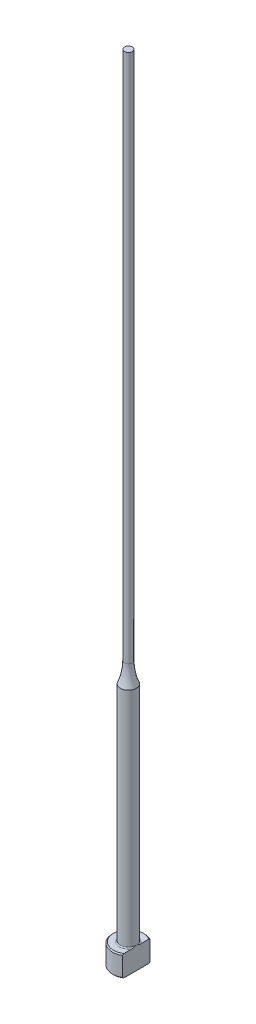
ISO-10303-21;
HEADER;
FILE_DESCRIPTION(('STEP AP214'),'2;1');
FILE_NAME('part.step','',(''),(''),'','','');
FILE_SCHEMA(('AUTOMOTIVE_DESIGN { 1 0 10303 214 1 1 1 1 }'));
ENDSEC;
DATA;
#1=APPLICATION_CONTEXT('core data for automotive mechanical design processes');
#2=APPLICATION_PROTOCOL_DEFINITION('international standard','automotive_design',2000,#1);
#3=PRODUCT_CONTEXT('',#1,'mechanical');
#4=PRODUCT('Part','Part','',(#3));
#5=PRODUCT_RELATED_PRODUCT_CATEGORY('part','',(#4));
#6=PRODUCT_DEFINITION_FORMATION('','',#4);
#7=PRODUCT_DEFINITION_CONTEXT('part definition',#1,'design');
#8=PRODUCT_DEFINITION('design','',#6,#7);
#9=PRODUCT_DEFINITION_SHAPE('','',#8);
#10=(LENGTH_UNIT() NAMED_UNIT(*) SI_UNIT(.MILLI.,.METRE.));
#11=(NAMED_UNIT(*) PLANE_ANGLE_UNIT() SI_UNIT($,.RADIAN.));
#12=(NAMED_UNIT(*) SI_UNIT($,.STERADIAN.) SOLID_ANGLE_UNIT());
#13=UNCERTAINTY_MEASURE_WITH_UNIT(LENGTH_MEASURE(1.E-05),#10,'distance_accuracy_value','');
#14=(GEOMETRIC_REPRESENTATION_CONTEXT(3) GLOBAL_UNCERTAINTY_ASSIGNED_CONTEXT((#13)) GLOBAL_UNIT_ASSIGNED_CONTEXT((#10,
#11,#12)) REPRESENTATION_CONTEXT('',''));
#15=CARTESIAN_POINT('',(0.,0.,0.));
#16=DIRECTION('',(0.,0.,1.));
#17=DIRECTION('',(1.,0.,0.));
#18=AXIS2_PLACEMENT_3D('',#15,#16,#17);
#19=CARTESIAN_POINT('',(-2.99999999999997,4.,0.));
#20=DIRECTION('',(0.,1.,0.));
#21=DIRECTION('',(0.,0.,1.));
#22=AXIS2_PLACEMENT_3D('',#19,#20,#21);
#23=PLANE('',#22);
#24=CARTESIAN_POINT('',(0.,4.,0.));
#25=DIRECTION('',(0.,1.,0.));
#26=DIRECTION('',(0.,0.,1.));
#27=AXIS2_PLACEMENT_3D('',#24,#25,#26);
#28=CIRCLE('',#27,2.79999999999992);
#29=CARTESIAN_POINT('',(1.49999999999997,4.,-2.3643180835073));
#30=VERTEX_POINT('',#29);
#31=CARTESIAN_POINT('',(1.49999999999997,4.,2.3643180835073));
#32=VERTEX_POINT('',#31);
#33=EDGE_CURVE('E187',#30,#32,#28,.T.);
#34=ORIENTED_EDGE('',*,*,#33,.T.);
#35=DIRECTION('',(0.,0.,-1.));
#36=VECTOR('',#35,1.);
#37=CARTESIAN_POINT('',(1.49999999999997,4.,0.));
#38=LINE('',#37,#36);
#39=CARTESIAN_POINT('',(1.49999999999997,3.99999999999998,0.799999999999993));
#40=VERTEX_POINT('',#39);
#41=EDGE_CURVE('E57',#32,#40,#38,.T.);
#42=ORIENTED_EDGE('',*,*,#41,.T.);
#43=CARTESIAN_POINT('',(0.,4.,0.));
#44=DIRECTION('',(0.,1.,0.));
#45=DIRECTION('',(0.,0.,1.));
#46=AXIS2_PLACEMENT_3D('',#43,#44,#45);
#47=CIRCLE('',#46,1.69999999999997);
#48=CARTESIAN_POINT('',(1.49999999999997,3.99999999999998,-0.799999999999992));
#49=VERTEX_POINT('',#48);
#50=EDGE_CURVE('E108',#40,#49,#47,.F.);
#51=ORIENTED_EDGE('',*,*,#50,.T.);
#52=EDGE_CURVE('E137',#49,#30,#38,.T.);
#53=ORIENTED_EDGE('',*,*,#52,.T.);
#54=EDGE_LOOP('',(#34,#42,#51,#53));
#55=FACE_BOUND('',#54,.T.);
#56=ADVANCED_FACE('F32',(#55),#23,.T.);
#57=CARTESIAN_POINT('',(0.,259.958771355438,0.));
#58=DIRECTION('',(0.,1.,0.));
#59=DIRECTION('',(0.,0.,1.));
#60=AXIS2_PLACEMENT_3D('',#57,#58,#59);
#61=CYLINDRICAL_SURFACE('',#60,2.99999999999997);
#62=CARTESIAN_POINT('',(0.,3.79999999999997,0.));
#63=DIRECTION('',(0.,1.,0.));
#64=DIRECTION('',(0.,0.,1.));
#65=AXIS2_PLACEMENT_3D('',#62,#63,#64);
#66=CIRCLE('',#65,2.99999999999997);
#67=CARTESIAN_POINT('',(1.49999999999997,3.79999999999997,2.5980762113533));
#68=VERTEX_POINT('',#67);
#69=CARTESIAN_POINT('',(1.49999999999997,3.79999999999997,-2.5980762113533));
#70=VERTEX_POINT('',#69);
#71=EDGE_CURVE('E105',#68,#70,#66,.F.);
#72=ORIENTED_EDGE('',*,*,#71,.T.);
#73=DIRECTION('',(0.,-1.,0.));
#74=VECTOR('',#73,1.);
#75=CARTESIAN_POINT('',(1.49999999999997,150.,-2.5980762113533));
#76=LINE('',#75,#74);
#77=CARTESIAN_POINT('',(1.49999999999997,0.199999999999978,-2.5980762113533));
#78=VERTEX_POINT('',#77);
#79=EDGE_CURVE('E193',#70,#78,#76,.T.);
#80=ORIENTED_EDGE('',*,*,#79,.T.);
#81=CARTESIAN_POINT('',(0.,0.199999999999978,0.));
#82=DIRECTION('',(0.,-1.,0.));
#83=DIRECTION('',(0.,0.,-1.));
#84=AXIS2_PLACEMENT_3D('',#81,#82,#83);
#85=CIRCLE('',#84,2.99999999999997);
#86=CARTESIAN_POINT('',(1.49999999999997,0.199999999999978,2.5980762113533));
#87=VERTEX_POINT('',#86);
#88=EDGE_CURVE('E100',#78,#87,#85,.F.);
#89=ORIENTED_EDGE('',*,*,#88,.T.);
#90=DIRECTION('',(0.,-1.,0.));
#91=VECTOR('',#90,1.);
#92=CARTESIAN_POINT('',(1.49999999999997,150.,2.5980762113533));
#93=LINE('',#92,#91);
#94=EDGE_CURVE('E93',#68,#87,#93,.T.);
#95=ORIENTED_EDGE('',*,*,#94,.F.);
#96=EDGE_LOOP('',(#72,#80,#89,#95));
#97=FACE_BOUND('',#96,.T.);
#98=ADVANCED_FACE('F158',(#97),#61,.T.);
#99=CARTESIAN_POINT('',(0.,0.,0.));
#100=DIRECTION('',(0.,-1.,0.));
#101=DIRECTION('',(0.,0.,-1.));
#102=AXIS2_PLACEMENT_3D('',#99,#100,#101);
#103=PLANE('',#102);
#104=CARTESIAN_POINT('',(0.,0.,0.));
#105=DIRECTION('',(0.,-1.,0.));
#106=DIRECTION('',(0.,0.,-1.));
#107=AXIS2_PLACEMENT_3D('',#104,#105,#106);
#108=CIRCLE('',#107,2.8);
#109=CARTESIAN_POINT('',(1.49999999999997,0.,2.36431808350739));
#110=VERTEX_POINT('',#109);
#111=CARTESIAN_POINT('',(1.49999999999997,0.,-2.36431808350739));
#112=VERTEX_POINT('',#111);
#113=EDGE_CURVE('E98',#110,#112,#108,.T.);
#114=ORIENTED_EDGE('',*,*,#113,.T.);
#115=DIRECTION('',(0.,0.,1.));
#116=VECTOR('',#115,1.);
#117=CARTESIAN_POINT('',(1.49999999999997,0.,2.5980762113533));
#118=LINE('',#117,#116);
#119=EDGE_CURVE('E83',#112,#110,#118,.T.);
#120=ORIENTED_EDGE('',*,*,#119,.T.);
#121=EDGE_LOOP('',(#114,#120));
#122=FACE_BOUND('',#121,.T.);
#123=ADVANCED_FACE('F103',(#122),#103,.T.);
#124=CARTESIAN_POINT('',(0.,4.,0.));
#125=DIRECTION('',(0.,-1.,0.));
#126=DIRECTION('',(0.,0.,-1.));
#127=AXIS2_PLACEMENT_3D('',#124,#125,#126);
#128=CONICAL_SURFACE('',#127,2.79999999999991,0.7853981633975);
#129=ORIENTED_EDGE('',*,*,#71,.F.);
#130=CARTESIAN_POINT('',(1.49999999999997,0.888258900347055,5.71827621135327));
#131=CARTESIAN_POINT('',(1.49999999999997,1.01361833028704,5.58866816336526));
#132=CARTESIAN_POINT('',(1.49999999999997,1.13884324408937,5.45892957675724));
#133=CARTESIAN_POINT('',(1.49999999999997,1.38894444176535,5.19911365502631));
#134=CARTESIAN_POINT('',(1.49999999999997,1.51382072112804,5.06903631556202));
#135=CARTESIAN_POINT('',(1.49999999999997,1.76320568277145,4.8084018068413));
#136=CARTESIAN_POINT('',(1.49999999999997,1.88771414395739,4.67784442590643));
#137=CARTESIAN_POINT('',(1.49999999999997,2.13618059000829,4.41620813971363));
#138=CARTESIAN_POINT('',(1.49999999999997,2.26013857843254,4.28512923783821));
#139=CARTESIAN_POINT('',(1.49999999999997,2.50488975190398,4.02490837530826));
#140=CARTESIAN_POINT('',(1.49999999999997,2.62569693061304,3.89577958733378));
#141=CARTESIAN_POINT('',(1.49999999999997,2.86640694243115,3.63668213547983));
#142=CARTESIAN_POINT('',(1.49999999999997,2.98630978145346,3.5067134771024));
#143=CARTESIAN_POINT('',(1.49999999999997,3.22486033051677,3.24567921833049));
#144=CARTESIAN_POINT('',(1.49999999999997,3.34350830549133,3.11461386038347));
#145=CARTESIAN_POINT('',(1.49999999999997,3.57907716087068,2.85094268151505));
#146=CARTESIAN_POINT('',(1.49999999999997,3.69599811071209,2.71833692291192));
#147=CARTESIAN_POINT('',(1.49999999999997,3.88262371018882,2.50255231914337));
#148=CARTESIAN_POINT('',(1.49999999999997,3.95312454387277,2.42006293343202));
#149=CARTESIAN_POINT('',(1.49999999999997,4.09287098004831,2.25401084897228));
#150=CARTESIAN_POINT('',(1.49999999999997,4.16211645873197,2.17044804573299));
#151=CARTESIAN_POINT('',(1.49999999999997,4.29964684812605,2.00105967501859));
#152=CARTESIAN_POINT('',(1.49999999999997,4.36791386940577,1.91521952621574));
#153=CARTESIAN_POINT('',(1.49999999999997,4.50205840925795,1.74171392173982));
#154=CARTESIAN_POINT('',(1.49999999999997,4.56793649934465,1.65404891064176));
#155=CARTESIAN_POINT('',(1.49999999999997,4.69728151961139,1.47490236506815));
#156=CARTESIAN_POINT('',(1.49999999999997,4.76069661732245,1.38338308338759));
#157=CARTESIAN_POINT('',(1.49999999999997,4.88239539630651,1.1967566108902));
#158=CARTESIAN_POINT('',(1.49999999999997,4.9406720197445,1.10164473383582));
#159=CARTESIAN_POINT('',(1.49999999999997,5.04841325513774,0.908008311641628));
#160=CARTESIAN_POINT('',(1.49999999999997,5.09797809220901,0.809540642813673));
#161=CARTESIAN_POINT('',(1.49999999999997,5.18432188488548,0.607192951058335));
#162=CARTESIAN_POINT('',(1.49999999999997,5.22114374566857,0.503332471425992));
#163=CARTESIAN_POINT('',(1.49999999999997,5.26099935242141,0.347577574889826));
#164=CARTESIAN_POINT('',(1.49999999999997,5.27157029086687,0.297609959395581));
#165=CARTESIAN_POINT('',(1.49999999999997,5.28794860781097,0.196885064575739));
#166=CARTESIAN_POINT('',(1.49999999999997,5.29375640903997,0.146127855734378));
#167=CARTESIAN_POINT('',(1.49999999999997,5.3001970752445,0.0444388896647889));
#168=CARTESIAN_POINT('',(1.49999999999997,5.3008459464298,-0.00649183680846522));
#169=CARTESIAN_POINT('',(1.49999999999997,5.29696416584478,-0.108155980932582));
#170=CARTESIAN_POINT('',(1.49999999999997,5.29243308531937,-0.158889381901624));
#171=CARTESIAN_POINT('',(1.49999999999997,5.2785691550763,-0.259234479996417));
#172=CARTESIAN_POINT('',(1.49999999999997,5.2692782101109,-0.308852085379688));
#173=CARTESIAN_POINT('',(1.49999999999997,5.24647108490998,-0.40711049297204));
#174=CARTESIAN_POINT('',(1.49999999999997,5.23295324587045,-0.455750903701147));
#175=CARTESIAN_POINT('',(1.49999999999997,5.20226175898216,-0.552149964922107));
#176=CARTESIAN_POINT('',(1.49999999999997,5.18506801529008,-0.5999021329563));
#177=CARTESIAN_POINT('',(1.49999999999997,5.14771387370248,-0.694205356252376));
#178=CARTESIAN_POINT('',(1.49999999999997,5.12755408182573,-0.740756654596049));
#179=CARTESIAN_POINT('',(1.49999999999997,5.06327696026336,-0.879166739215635));
#180=CARTESIAN_POINT('',(1.49999999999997,5.01551721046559,-0.969329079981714));
#181=CARTESIAN_POINT('',(1.49999999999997,4.91367909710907,-1.1460431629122));
#182=CARTESIAN_POINT('',(1.49999999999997,4.85959300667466,-1.23259031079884));
#183=CARTESIAN_POINT('',(1.49999999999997,4.74697968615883,-1.40321348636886));
#184=CARTESIAN_POINT('',(1.49999999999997,4.68843573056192,-1.48727838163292));
#185=CARTESIAN_POINT('',(1.49999999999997,4.56843845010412,-1.6532218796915));
#186=CARTESIAN_POINT('',(1.49999999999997,4.50698656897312,-1.73510153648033));
#187=CARTESIAN_POINT('',(1.49999999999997,4.38115673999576,-1.89829823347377));
#188=CARTESIAN_POINT('',(1.49999999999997,4.31675092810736,-1.9795936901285));
#189=CARTESIAN_POINT('',(1.49999999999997,4.18634068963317,-2.14090082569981));
#190=CARTESIAN_POINT('',(1.49999999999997,4.12033609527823,-2.22091236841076));
#191=CARTESIAN_POINT('',(1.49999999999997,3.92086431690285,-2.45906508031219));
#192=CARTESIAN_POINT('',(1.49999999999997,3.78562663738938,-2.61572090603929));
#193=CARTESIAN_POINT('',(1.49999999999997,3.53554498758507,-2.90006295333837));
#194=CARTESIAN_POINT('',(1.49999999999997,3.42114543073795,-3.02814382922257));
#195=CARTESIAN_POINT('',(1.49999999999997,3.19093557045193,-3.28303767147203));
#196=CARTESIAN_POINT('',(1.49999999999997,3.07512522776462,-3.40985060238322));
#197=CARTESIAN_POINT('',(1.49999999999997,2.72597067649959,-3.78913849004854));
#198=CARTESIAN_POINT('',(1.49999999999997,2.49111760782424,-4.04022177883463));
#199=CARTESIAN_POINT('',(1.49999999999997,2.02882478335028,-4.52992803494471));
#200=CARTESIAN_POINT('',(1.49999999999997,1.80147747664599,-4.76863870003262));
#201=CARTESIAN_POINT('',(1.49999999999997,1.45954865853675,-5.12558036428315));
#202=CARTESIAN_POINT('',(1.49999999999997,1.34548484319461,-5.24430773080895));
#203=CARTESIAN_POINT('',(1.49999999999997,1.11707176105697,-5.48148573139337));
#204=CARTESIAN_POINT('',(1.49999999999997,1.00272249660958,-5.59993636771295));
#205=CARTESIAN_POINT('',(1.49999999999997,0.888258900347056,-5.71827621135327));
#206=B_SPLINE_CURVE_WITH_KNOTS('',3,(#130,#131,#132,#133,#134,#135,#136,#137,#138,#139,#140,
#141,#142,#143,#144,#145,#146,#147,#148,#149,#150,#151,#152,#153,#154,#155,#156,#157,#158,#159,
#160,#161,#162,#163,#164,#165,#166,#167,#168,#169,#170,#171,#172,#173,#174,#175,#176,#177,#178,
#179,#180,#181,#182,#183,#184,#185,#186,#187,#188,#189,#190,#191,#192,#193,#194,#195,#196,#197,
#198,#199,#200,#201,#202,#203,#204,#205),.UNSPECIFIED.,.F.,.F.,(4,2,2,2,2,2,2,2,2,2,2,2,2,2,2,2,
2,2,2,2,2,2,2,2,2,2,2,2,2,2,2,2,2,2,2,2,2,4),(0.,0.540943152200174,1.08189327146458,
1.62312052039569,2.16434426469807,2.69482920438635,3.22531067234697,3.75567781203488,
4.28602356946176,4.61155053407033,4.93710943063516,5.26610945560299,5.59503024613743,
5.92894782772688,6.26331713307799,6.59354403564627,6.92264800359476,7.07567478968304,
7.22868799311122,7.38122626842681,7.53377717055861,7.68500755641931,7.83629736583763,
7.98843643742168,8.14054446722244,8.4461879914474,8.75220879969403,9.05944044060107,
9.366521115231,9.677642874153,9.98879742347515,10.6095925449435,11.1247803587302,
11.6399825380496,12.6713544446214,13.6603005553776,14.1542238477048,14.648143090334),.UNSPECIFIED.);
#207=EDGE_CURVE('E136',#68,#32,#206,.T.);
#208=ORIENTED_EDGE('',*,*,#207,.T.);
#209=ORIENTED_EDGE('',*,*,#33,.F.);
#210=EDGE_CURVE('E128',#30,#70,#206,.T.);
#211=ORIENTED_EDGE('',*,*,#210,.T.);
#212=EDGE_LOOP('',(#129,#208,#209,#211));
#213=FACE_BOUND('',#212,.T.);
#214=ADVANCED_FACE('F144',(#213),#128,.T.);
#215=CARTESIAN_POINT('',(0.,0.199999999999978,0.));
#216=DIRECTION('',(0.,1.,0.));
#217=DIRECTION('',(0.,0.,1.));
#218=AXIS2_PLACEMENT_3D('',#215,#216,#217);
#219=CONICAL_SURFACE('',#218,2.99999999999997,0.785398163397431);
#220=ORIENTED_EDGE('',*,*,#88,.F.);
#221=CARTESIAN_POINT('',(1.49999999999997,3.1117410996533,-5.71827621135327));
#222=CARTESIAN_POINT('',(1.49999999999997,2.98638166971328,-5.58866816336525));
#223=CARTESIAN_POINT('',(1.49999999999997,2.86115675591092,-5.45892957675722));
#224=CARTESIAN_POINT('',(1.49999999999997,2.61105555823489,-5.19911365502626));
#225=CARTESIAN_POINT('',(1.49999999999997,2.48617927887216,-5.06903631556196));
#226=CARTESIAN_POINT('',(1.49999999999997,2.23679431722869,-4.80840180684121));
#227=CARTESIAN_POINT('',(1.49999999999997,2.11228585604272,-4.67784442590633));
#228=CARTESIAN_POINT('',(1.49999999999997,1.86381940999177,-4.4162081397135));
#229=CARTESIAN_POINT('',(1.49999999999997,1.73986142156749,-4.28512923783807));
#230=CARTESIAN_POINT('',(1.49999999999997,1.49511024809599,-4.02490837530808));
#231=CARTESIAN_POINT('',(1.49999999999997,1.3743030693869,-3.8957795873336));
#232=CARTESIAN_POINT('',(1.49999999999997,1.13359305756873,-3.63668213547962));
#233=CARTESIAN_POINT('',(1.49999999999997,1.0136902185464,-3.50671347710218));
#234=CARTESIAN_POINT('',(1.49999999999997,0.77513966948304,-3.24567921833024));
#235=CARTESIAN_POINT('',(1.49999999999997,0.656491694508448,-3.11461386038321));
#236=CARTESIAN_POINT('',(1.49999999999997,0.420922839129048,-2.85094268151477));
#237=CARTESIAN_POINT('',(1.49999999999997,0.30400188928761,-2.71833692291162));
#238=CARTESIAN_POINT('',(1.49999999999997,0.11737628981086,-2.50255231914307));
#239=CARTESIAN_POINT('',(1.49999999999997,0.046875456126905,-2.42006293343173));
#240=CARTESIAN_POINT('',(1.49999999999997,-0.0928709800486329,-2.254010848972));
#241=CARTESIAN_POINT('',(1.49999999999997,-0.162116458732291,-2.17044804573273));
#242=CARTESIAN_POINT('',(1.49999999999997,-0.299646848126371,-2.00105967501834));
#243=CARTESIAN_POINT('',(1.49999999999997,-0.367913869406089,-1.9152195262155));
#244=CARTESIAN_POINT('',(1.49999999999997,-0.502058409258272,-1.7417139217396));
#245=CARTESIAN_POINT('',(1.49999999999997,-0.567936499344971,-1.65404891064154));
#246=CARTESIAN_POINT('',(1.49999999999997,-0.697281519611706,-1.47490236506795));
#247=CARTESIAN_POINT('',(1.49999999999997,-0.76069661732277,-1.38338308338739));
#248=CARTESIAN_POINT('',(1.49999999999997,-0.882395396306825,-1.19675661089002));
#249=CARTESIAN_POINT('',(1.49999999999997,-0.940672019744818,-1.10164473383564));
#250=CARTESIAN_POINT('',(1.49999999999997,-1.04841325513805,-0.908008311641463));
#251=CARTESIAN_POINT('',(1.49999999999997,-1.09797809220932,-0.809540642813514));
#252=CARTESIAN_POINT('',(1.49999999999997,-1.18432188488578,-0.607192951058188));
#253=CARTESIAN_POINT('',(1.49999999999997,-1.22114374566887,-0.50333247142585));
#254=CARTESIAN_POINT('',(1.49999999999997,-1.26099935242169,-0.347577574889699));
#255=CARTESIAN_POINT('',(1.49999999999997,-1.27157029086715,-0.297609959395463));
#256=CARTESIAN_POINT('',(1.49999999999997,-1.28794860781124,-0.196885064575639));
#257=CARTESIAN_POINT('',(1.49999999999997,-1.29375640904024,-0.146127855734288));
#258=CARTESIAN_POINT('',(1.49999999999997,-1.30019707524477,-0.0444388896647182));
#259=CARTESIAN_POINT('',(1.49999999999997,-1.30084594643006,0.00649183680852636));
#260=CARTESIAN_POINT('',(1.49999999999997,-1.29696416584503,0.108155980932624));
#261=CARTESIAN_POINT('',(1.49999999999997,-1.29243308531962,0.158889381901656));
#262=CARTESIAN_POINT('',(1.49999999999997,-1.27856915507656,0.25923447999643));
#263=CARTESIAN_POINT('',(1.49999999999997,-1.26927821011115,0.308852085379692));
#264=CARTESIAN_POINT('',(1.49999999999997,-1.24647108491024,0.407110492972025));
#265=CARTESIAN_POINT('',(1.49999999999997,-1.2329532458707,0.455750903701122));
#266=CARTESIAN_POINT('',(1.49999999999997,-1.20226175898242,0.552149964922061));
#267=CARTESIAN_POINT('',(1.49999999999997,-1.18506801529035,0.599902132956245));
#268=CARTESIAN_POINT('',(1.49999999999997,-1.14771387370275,0.694205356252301));
#269=CARTESIAN_POINT('',(1.49999999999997,-1.12755408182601,0.740756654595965));
#270=CARTESIAN_POINT('',(1.49999999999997,-1.06327696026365,0.879166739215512));
#271=CARTESIAN_POINT('',(1.49999999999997,-1.0155172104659,0.969329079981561));
#272=CARTESIAN_POINT('',(1.49999999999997,-0.913679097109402,1.14604316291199));
#273=CARTESIAN_POINT('',(1.49999999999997,-0.859593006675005,1.2325903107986));
#274=CARTESIAN_POINT('',(1.49999999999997,-0.746979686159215,1.40321348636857));
#275=CARTESIAN_POINT('',(1.49999999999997,-0.688435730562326,1.4872783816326));
#276=CARTESIAN_POINT('',(1.49999999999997,-0.568438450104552,1.65322187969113));
#277=CARTESIAN_POINT('',(1.49999999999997,-0.506986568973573,1.73510153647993));
#278=CARTESIAN_POINT('',(1.49999999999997,-0.381156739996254,1.89829823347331));
#279=CARTESIAN_POINT('',(1.49999999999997,-0.316750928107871,1.97959369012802));
#280=CARTESIAN_POINT('',(1.49999999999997,-0.18634068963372,2.14090082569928));
#281=CARTESIAN_POINT('',(1.49999999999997,-0.120336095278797,2.22091236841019));
#282=CARTESIAN_POINT('',(1.49999999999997,0.0791356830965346,2.45906508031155));
#283=CARTESIAN_POINT('',(1.49999999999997,0.214373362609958,2.61572090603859));
#284=CARTESIAN_POINT('',(1.49999999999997,0.464455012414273,2.90006295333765));
#285=CARTESIAN_POINT('',(1.49999999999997,0.578854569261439,3.02814382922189));
#286=CARTESIAN_POINT('',(1.49999999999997,0.809064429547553,3.28303767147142));
#287=CARTESIAN_POINT('',(1.49999999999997,0.924874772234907,3.40985060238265));
#288=CARTESIAN_POINT('',(1.49999999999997,1.27402932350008,3.78913849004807));
#289=CARTESIAN_POINT('',(1.49999999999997,1.50888239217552,4.04022177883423));
#290=CARTESIAN_POINT('',(1.49999999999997,1.97117521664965,4.52992803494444));
#291=CARTESIAN_POINT('',(1.49999999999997,2.19852252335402,4.76863870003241));
#292=CARTESIAN_POINT('',(1.49999999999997,2.54045134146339,5.12558036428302));
#293=CARTESIAN_POINT('',(1.49999999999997,2.65451515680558,5.24430773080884));
#294=CARTESIAN_POINT('',(1.49999999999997,2.8829282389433,5.48148573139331));
#295=CARTESIAN_POINT('',(1.49999999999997,2.99727750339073,5.59993636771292));
#296=CARTESIAN_POINT('',(1.49999999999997,3.1117410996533,5.71827621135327));
#297=B_SPLINE_CURVE_WITH_KNOTS('',3,(#221,#222,#223,#224,#225,#226,#227,#228,#229,#230,#231,
#232,#233,#234,#235,#236,#237,#238,#239,#240,#241,#242,#243,#244,#245,#246,#247,#248,#249,#250,
#251,#252,#253,#254,#255,#256,#257,#258,#259,#260,#261,#262,#263,#264,#265,#266,#267,#268,#269,
#270,#271,#272,#273,#274,#275,#276,#277,#278,#279,#280,#281,#282,#283,#284,#285,#286,#287,#288,
#289,#290,#291,#292,#293,#294,#295,#296),.UNSPECIFIED.,.F.,.F.,(4,2,2,2,2,2,2,2,2,2,2,2,2,2,2,2,
2,2,2,2,2,2,2,2,2,2,2,2,2,2,2,2,2,2,2,2,2,4),(0.,0.540943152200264,1.08189327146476,
1.62312052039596,2.16434426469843,2.69482920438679,3.22531067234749,3.75567781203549,
4.28602356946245,4.611550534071,4.9371094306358,5.26610945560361,5.59503024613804,
5.92894782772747,6.26331713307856,6.59354403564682,6.92264800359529,7.07567478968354,
7.22868799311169,7.38122626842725,7.53377717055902,7.6850075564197,7.83629736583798,
7.98843643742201,8.14054446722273,8.44618799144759,8.75220879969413,9.05944044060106,
9.3665211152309,9.6776428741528,9.98879742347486,10.609592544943,11.1247803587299,
11.6399825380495,12.6713544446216,13.6603005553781,14.1542238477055,14.6481430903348),.UNSPECIFIED.);
#298=EDGE_CURVE('E86',#78,#112,#297,.T.);
#299=ORIENTED_EDGE('',*,*,#298,.T.);
#300=ORIENTED_EDGE('',*,*,#113,.F.);
#301=EDGE_CURVE('E89',#110,#87,#297,.T.);
#302=ORIENTED_EDGE('',*,*,#301,.T.);
#303=EDGE_LOOP('',(#220,#299,#300,#302));
#304=FACE_BOUND('',#303,.T.);
#305=ADVANCED_FACE('F97',(#304),#219,.T.);
#306=CARTESIAN_POINT('',(0.,4.19999999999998,0.));
#307=DIRECTION('',(0.,1.,0.));
#308=DIRECTION('',(0.,0.,1.));
#309=AXIS2_PLACEMENT_3D('',#306,#307,#308);
#310=TOROIDAL_SURFACE('',#309,1.69999999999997,0.2);
#311=CARTESIAN_POINT('',(1.49999999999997,4.19999999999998,0.));
#312=CARTESIAN_POINT('',(1.49999999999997,4.20000050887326,7.14686674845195E-11));
#313=CARTESIAN_POINT('',(1.49999999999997,4.20000101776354,-1.21663673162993E-07));
#314=CARTESIAN_POINT('',(1.49999999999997,4.20000199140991,-4.97616237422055E-07));
#315=CARTESIAN_POINT('',(1.49999999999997,4.20000245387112,-7.56516220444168E-07));
#316=CARTESIAN_POINT('',(1.49999999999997,4.20000338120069,-1.37642837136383E-06));
#317=CARTESIAN_POINT('',(1.49999999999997,4.20000384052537,-1.74563476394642E-06));
#318=CARTESIAN_POINT('',(1.49999999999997,4.20000469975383,-2.53565984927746E-06));
#319=CARTESIAN_POINT('',(1.49999999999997,4.20000510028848,-2.95582597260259E-06));
#320=CARTESIAN_POINT('',(1.49999999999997,4.20000646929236,-4.48430445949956E-06));
#321=CARTESIAN_POINT('',(1.49999999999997,4.20000736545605,-5.6586103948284E-06));
#322=CARTESIAN_POINT('',(1.49999999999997,4.20000893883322,-8.06479202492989E-06));
#323=CARTESIAN_POINT('',(1.49999999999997,4.20000962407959,-9.29170517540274E-06));
#324=CARTESIAN_POINT('',(1.49999999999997,4.20001225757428,-1.416232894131E-05));
#325=CARTESIAN_POINT('',(1.49999999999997,4.20001407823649,-1.78790031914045E-05));
#326=CARTESIAN_POINT('',(1.49999999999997,4.20001699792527,-2.51443066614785E-05));
#327=CARTESIAN_POINT('',(1.49999999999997,4.20001815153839,-2.86715394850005E-05));
#328=CARTESIAN_POINT('',(1.49999999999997,4.20002315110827,-4.39218128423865E-05));
#329=CARTESIAN_POINT('',(1.49999999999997,4.20002701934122,-5.56288390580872E-05));
#330=CARTESIAN_POINT('',(1.49999999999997,4.20003312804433,-7.7405829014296E-05));
#331=CARTESIAN_POINT('',(1.49999999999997,4.20003553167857,-8.74278412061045E-05));
#332=CARTESIAN_POINT('',(1.49999999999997,4.20005483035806,-0.000161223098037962));
#333=CARTESIAN_POINT('',(1.49999999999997,4.20007979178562,-0.000222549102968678));
#334=CARTESIAN_POINT('',(1.49999999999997,4.20017391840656,-0.000462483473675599));
#335=CARTESIAN_POINT('',(1.49999999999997,4.20023706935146,-0.000642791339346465));
#336=CARTESIAN_POINT('',(1.49999999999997,4.20048761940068,-0.00134785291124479));
#337=CARTESIAN_POINT('',(1.49999999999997,4.20068132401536,-0.00187087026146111));
#338=CARTESIAN_POINT('',(1.49999999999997,4.20147357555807,-0.00402004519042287));
#339=CARTESIAN_POINT('',(1.49999999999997,4.20206499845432,-0.0056481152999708));
#340=CARTESIAN_POINT('',(1.49999999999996,4.20892634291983,-0.0245232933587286));
#341=CARTESIAN_POINT('',(1.49999999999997,4.21523683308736,-0.041759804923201));
#342=CARTESIAN_POINT('',(1.49999999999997,4.22755028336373,-0.0756091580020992));
#343=CARTESIAN_POINT('',(1.49999999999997,4.23355589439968,-0.0922211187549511));
#344=CARTESIAN_POINT('',(1.49999999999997,4.24620101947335,-0.127454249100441));
#345=CARTESIAN_POINT('',(1.49999999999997,4.25283080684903,-0.146078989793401));
#346=CARTESIAN_POINT('',(1.49999999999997,4.26599765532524,-0.183577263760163));
#347=CARTESIAN_POINT('',(1.49999999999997,4.27253305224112,-0.202451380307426));
#348=CARTESIAN_POINT('',(1.49999999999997,4.28834228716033,-0.248982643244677));
#349=CARTESIAN_POINT('',(1.49999999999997,4.2974915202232,-0.276682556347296));
#350=CARTESIAN_POINT('',(1.49999999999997,4.31490935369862,-0.331625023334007));
#351=CARTESIAN_POINT('',(1.49999999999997,4.3231938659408,-0.358862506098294));
#352=CARTESIAN_POINT('',(1.49999999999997,4.34051594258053,-0.419125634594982));
#353=CARTESIAN_POINT('',(1.49999999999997,4.34936607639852,-0.452206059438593));
#354=CARTESIAN_POINT('',(1.49999999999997,4.36549583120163,-0.519023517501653));
#355=CARTESIAN_POINT('',(1.49999999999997,4.37276283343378,-0.552763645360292));
#356=CARTESIAN_POINT('',(1.49999999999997,4.38554755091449,-0.62305310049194));
#357=CARTESIAN_POINT('',(1.49999999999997,4.39090573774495,-0.65963271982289));
#358=CARTESIAN_POINT('',(1.49999999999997,4.39825016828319,-0.733028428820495));
#359=CARTESIAN_POINT('',(1.49999999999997,4.40024734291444,-0.76984335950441));
#360=CARTESIAN_POINT('',(1.49999999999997,4.39970780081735,-0.842856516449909));
#361=CARTESIAN_POINT('',(1.49999999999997,4.39725347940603,-0.879053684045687));
#362=CARTESIAN_POINT('',(1.49999999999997,4.38900085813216,-0.93238076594));
#363=CARTESIAN_POINT('',(1.49999999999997,4.38553049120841,-0.949868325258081));
#364=CARTESIAN_POINT('',(1.49999999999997,4.37678336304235,-0.984374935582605));
#365=CARTESIAN_POINT('',(1.49999999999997,4.37150943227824,-1.00139467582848));
#366=CARTESIAN_POINT('',(1.49999999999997,4.35869781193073,-1.03479423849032));
#367=CARTESIAN_POINT('',(1.49999999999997,4.3511359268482,-1.05116499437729));
#368=CARTESIAN_POINT('',(1.49999999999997,4.33325333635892,-1.08234828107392));
#369=CARTESIAN_POINT('',(1.49999999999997,4.32294266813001,-1.09716621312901));
#370=CARTESIAN_POINT('',(1.49999999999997,4.30512758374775,-1.11714173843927));
#371=CARTESIAN_POINT('',(1.49999999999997,4.29884721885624,-1.12339066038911));
#372=CARTESIAN_POINT('',(1.49999999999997,4.28545950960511,-1.13494695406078));
#373=CARTESIAN_POINT('',(1.49999999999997,4.27835226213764,-1.14025443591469));
#374=CARTESIAN_POINT('',(1.49999999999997,4.26325970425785,-1.14967631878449));
#375=CARTESIAN_POINT('',(1.49999999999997,4.25526534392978,-1.15377649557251));
#376=CARTESIAN_POINT('',(1.49999999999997,4.23863207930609,-1.16034952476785));
#377=CARTESIAN_POINT('',(1.49999999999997,4.22999427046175,-1.16282507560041));
#378=CARTESIAN_POINT('',(1.49999999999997,4.21343922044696,-1.16570267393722));
#379=CARTESIAN_POINT('',(1.49999999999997,4.20555896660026,-1.16631687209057));
#380=CARTESIAN_POINT('',(1.49999999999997,4.18982775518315,-1.16602054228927));
#381=CARTESIAN_POINT('',(1.49999999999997,4.18197679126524,-1.16511036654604));
#382=CARTESIAN_POINT('',(1.49999999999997,4.16747846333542,-1.16204446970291));
#383=CARTESIAN_POINT('',(1.49999999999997,4.16079696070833,-1.16004509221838));
#384=CARTESIAN_POINT('',(1.49999999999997,4.14781700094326,-1.15505972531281));
#385=CARTESIAN_POINT('',(1.49999999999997,4.14151862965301,-1.1520735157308));
#386=CARTESIAN_POINT('',(1.49999999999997,4.12690214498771,-1.14387585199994));
#387=CARTESIAN_POINT('',(1.49999999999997,4.11881436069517,-1.13825400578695));
#388=CARTESIAN_POINT('',(1.49999999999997,4.1036444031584,-1.12578441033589));
#389=CARTESIAN_POINT('',(1.49999999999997,4.09656475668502,-1.11893367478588));
#390=CARTESIAN_POINT('',(1.49999999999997,4.08012297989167,-1.10074342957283));
#391=CARTESIAN_POINT('',(1.49999999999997,4.07136543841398,-1.08886044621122));
#392=CARTESIAN_POINT('',(1.49999999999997,4.05578194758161,-1.06392743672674));
#393=CARTESIAN_POINT('',(1.49999999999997,4.0489571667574,-1.05087671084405));
#394=CARTESIAN_POINT('',(1.49999999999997,4.03273856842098,-1.01472307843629));
#395=CARTESIAN_POINT('',(1.49999999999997,4.02486230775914,-0.990945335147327));
#396=CARTESIAN_POINT('',(1.49999999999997,4.01257693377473,-0.94232199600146));
#397=CARTESIAN_POINT('',(1.49999999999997,4.00820590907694,-0.917467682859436));
#398=CARTESIAN_POINT('',(1.49999999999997,4.00229956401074,-0.867912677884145));
#399=CARTESIAN_POINT('',(1.49999999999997,4.0007128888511,-0.843217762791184));
#400=CARTESIAN_POINT('',(1.49999999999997,3.9996723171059,-0.79374605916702));
#401=CARTESIAN_POINT('',(1.49999999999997,4.0002230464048,-0.768969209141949));
#402=CARTESIAN_POINT('',(1.49999999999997,4.00433101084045,-0.696994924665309));
#403=CARTESIAN_POINT('',(1.49999999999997,4.01016976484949,-0.64993124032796));
#404=CARTESIAN_POINT('',(1.49999999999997,4.02567776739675,-0.559166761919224));
#405=CARTESIAN_POINT('',(1.49999999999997,4.03511950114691,-0.515423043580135));
#406=CARTESIAN_POINT('',(1.49999999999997,4.05693059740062,-0.427590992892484));
#407=CARTESIAN_POINT('',(1.49999999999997,4.06936356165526,-0.383518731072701));
#408=CARTESIAN_POINT('',(1.49999999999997,4.09174953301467,-0.310161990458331));
#409=CARTESIAN_POINT('',(1.49999999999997,4.10119843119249,-0.280718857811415));
#410=CARTESIAN_POINT('',(1.49999999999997,4.12060442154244,-0.22234098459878));
#411=CARTESIAN_POINT('',(1.49999999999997,4.13055519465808,-0.193404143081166));
#412=CARTESIAN_POINT('',(1.49999999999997,4.14973721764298,-0.138756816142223));
#413=CARTESIAN_POINT('',(1.49999999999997,4.15893123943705,-0.113033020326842));
#414=CARTESIAN_POINT('',(1.49999999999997,4.17788037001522,-0.0606351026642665));
#415=CARTESIAN_POINT('',(1.49999999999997,4.18764328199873,-0.0339636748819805));
#416=CARTESIAN_POINT('',(1.49999999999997,4.19793548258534,-0.00564657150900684));
#417=CARTESIAN_POINT('',(1.49999999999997,4.19852751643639,-0.00401699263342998));
#418=CARTESIAN_POINT('',(1.49999999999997,4.1993199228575,-0.0018674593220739));
#419=CARTESIAN_POINT('',(1.49999999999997,4.19951319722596,-0.00134559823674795));
#420=CARTESIAN_POINT('',(1.49999999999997,4.19976322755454,-0.000641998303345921));
#421=CARTESIAN_POINT('',(1.49999999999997,4.19982627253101,-0.000461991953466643));
#422=CARTESIAN_POINT('',(1.49999999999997,4.19992025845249,-0.000222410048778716));
#423=CARTESIAN_POINT('',(1.49999999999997,4.19994519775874,-0.000161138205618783));
#424=CARTESIAN_POINT('',(1.49999999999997,4.19996448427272,-8.74039267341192E-05));
#425=CARTESIAN_POINT('',(1.49999999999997,4.19996688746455,-7.73857556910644E-05));
#426=CARTESIAN_POINT('',(1.49999999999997,4.1999729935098,-5.56173272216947E-05));
#427=CARTESIAN_POINT('',(1.49999999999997,4.19997685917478,-4.39149186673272E-05));
#428=CARTESIAN_POINT('',(1.49999999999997,4.19998185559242,-2.86698156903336E-05));
#429=CARTESIAN_POINT('',(1.49999999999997,4.19998300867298,-2.51431575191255E-05));
#430=CARTESIAN_POINT('',(1.49999999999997,4.19998592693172,-1.78789552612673E-05));
#431=CARTESIAN_POINT('',(1.49999999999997,4.19998774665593,-1.41627846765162E-05));
#432=CARTESIAN_POINT('',(1.49999999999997,4.19999037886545,-9.29264488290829E-06));
#433=CARTESIAN_POINT('',(1.49999999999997,4.19999106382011,-8.06577599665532E-06));
#434=CARTESIAN_POINT('',(1.49999999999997,4.19999263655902,-5.65962639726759E-06));
#435=CARTESIAN_POINT('',(1.49999999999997,4.19999353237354,-4.48530466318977E-06));
#436=CARTESIAN_POINT('',(1.49999999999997,4.19999490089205,-2.95673740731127E-06));
#437=CARTESIAN_POINT('',(1.49999999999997,4.1999953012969,-2.53653208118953E-06));
#438=CARTESIAN_POINT('',(1.49999999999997,4.19999616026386,-1.74640525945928E-06));
#439=CARTESIAN_POINT('',(1.49999999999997,4.19999661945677,-1.37713598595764E-06));
#440=CARTESIAN_POINT('',(1.49999999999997,4.19999754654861,-7.57072336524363E-07));
#441=CARTESIAN_POINT('',(1.49999999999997,4.19999800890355,-4.9808738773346E-07));
#442=CARTESIAN_POINT('',(1.49999999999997,4.19999898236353,-1.21927249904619E-07));
#443=CARTESIAN_POINT('',(1.49999999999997,4.19999949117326,-7.14621294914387E-11));
#444=CARTESIAN_POINT('',(1.49999999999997,4.19999999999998,0.));
#445=B_SPLINE_CURVE_WITH_KNOTS('',3,(#311,#312,#313,#314,#315,#316,#317,#318,#319,#320,#321,
#322,#323,#324,#325,#326,#327,#328,#329,#330,#331,#332,#333,#334,#335,#336,#337,#338,#339,#340,
#341,#342,#343,#344,#345,#346,#347,#348,#349,#350,#351,#352,#353,#354,#355,#356,#357,#358,#359,
#360,#361,#362,#363,#364,#365,#366,#367,#368,#369,#370,#371,#372,#373,#374,#375,#376,#377,#378,
#379,#380,#381,#382,#383,#384,#385,#386,#387,#388,#389,#390,#391,#392,#393,#394,#395,#396,#397,
#398,#399,#400,#401,#402,#403,#404,#405,#406,#407,#408,#409,#410,#411,#412,#413,#414,#415,#416,
#417,#418,#419,#420,#421,#422,#423,#424,#425,#426,#427,#428,#429,#430,#431,#432,#433,#434,#435,
#436,#437,#438,#439,#440,#441,#442,#443,#444),.UNSPECIFIED.,.T.,.F.,(4,2,2,2,2,2,2,2,2,2,2,2,2,
2,2,2,2,2,2,2,2,2,2,2,2,2,2,2,2,2,2,2,2,2,2,2,2,2,2,2,2,2,2,2,2,2,2,2,2,2,2,2,2,2,2,2,2,2,2,2,2,
2,2,2,2,2,4),(0.,1.5268750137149E-06,3.10959387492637E-06,4.86976756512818E-06,
6.60940084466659E-06,1.10202525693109E-05,1.5232779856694E-05,2.7614037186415E-05,
3.87351645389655E-05,7.57188332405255E-05,0.000106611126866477,0.000304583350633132,
0.00087827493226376,0.00255078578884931,0.0077480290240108,0.0628090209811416,0.115802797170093,
0.175110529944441,0.23503061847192,0.32253950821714,0.407938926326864,0.510638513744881,
0.614128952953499,0.724918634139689,0.835347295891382,0.943752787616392,0.997165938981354,
1.05049564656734,1.10441029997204,1.15813071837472,1.18463966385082,1.21114550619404,
1.23795217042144,1.26471419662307,1.2882832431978,1.31184684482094,1.33268332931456,
1.35352446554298,1.38290826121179,1.41236445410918,1.45639976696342,1.50046164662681,
1.57518788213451,1.65071550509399,1.72483484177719,1.79911468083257,1.94105061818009,
2.07520625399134,2.2125154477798,2.30527614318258,2.39707056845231,2.47902409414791,
2.56422207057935,2.56942417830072,2.57109299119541,2.57166572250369,2.57186352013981,
2.57189440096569,2.57193136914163,2.57194248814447,2.57195486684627,2.57195907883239,
2.57196348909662,2.57196522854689,2.57196698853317,2.57196857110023,2.57197009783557),.UNSPECIFIED.);
#446=CARTESIAN_POINT('',(1.49999999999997,4.19999999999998,0.));
#447=VERTEX_POINT('',#446);
#448=EDGE_CURVE('E11',#49,#447,#445,.T.);
#449=ORIENTED_EDGE('',*,*,#448,.F.);
#450=ORIENTED_EDGE('',*,*,#50,.F.);
#451=CARTESIAN_POINT('',(1.49999999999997,4.19999999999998,0.));
#452=CARTESIAN_POINT('',(1.49999999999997,4.1999994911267,-7.1468641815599E-11));
#453=CARTESIAN_POINT('',(1.49999999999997,4.19999898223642,1.21663673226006E-07));
#454=CARTESIAN_POINT('',(1.49999999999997,4.19999800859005,4.97616237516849E-07));
#455=CARTESIAN_POINT('',(1.49999999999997,4.19999754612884,7.56516220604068E-07));
#456=CARTESIAN_POINT('',(1.49999999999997,4.19999661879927,1.37642837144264E-06));
#457=CARTESIAN_POINT('',(1.49999999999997,4.1999961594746,1.74563476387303E-06));
#458=CARTESIAN_POINT('',(1.49999999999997,4.19999530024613,2.5356598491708E-06));
#459=CARTESIAN_POINT('',(1.49999999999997,4.19999489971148,2.95582597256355E-06));
#460=CARTESIAN_POINT('',(1.49999999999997,4.1999935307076,4.48430445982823E-06));
#461=CARTESIAN_POINT('',(1.49999999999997,4.19999263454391,5.6586103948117E-06));
#462=CARTESIAN_POINT('',(1.49999999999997,4.19999106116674,8.06479202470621E-06));
#463=CARTESIAN_POINT('',(1.49999999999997,4.19999037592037,9.29170517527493E-06));
#464=CARTESIAN_POINT('',(1.49999999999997,4.19998774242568,1.41623289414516E-05));
#465=CARTESIAN_POINT('',(1.49999999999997,4.19998592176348,1.78790031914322E-05));
#466=CARTESIAN_POINT('',(1.49999999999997,4.1999830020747,2.51443066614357E-05));
#467=CARTESIAN_POINT('',(1.49999999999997,4.19998184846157,2.86715394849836E-05));
#468=CARTESIAN_POINT('',(1.49999999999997,4.1999768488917,4.39218128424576E-05));
#469=CARTESIAN_POINT('',(1.49999999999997,4.19997298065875,5.56288390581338E-05));
#470=CARTESIAN_POINT('',(1.49999999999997,4.19996687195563,7.7405829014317E-05));
#471=CARTESIAN_POINT('',(1.49999999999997,4.19996446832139,8.74278412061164E-05));
#472=CARTESIAN_POINT('',(1.49999999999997,4.1999451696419,0.000161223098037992));
#473=CARTESIAN_POINT('',(1.49999999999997,4.19992020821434,0.000222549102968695));
#474=CARTESIAN_POINT('',(1.49999999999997,4.19982608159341,0.000462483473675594));
#475=CARTESIAN_POINT('',(1.49999999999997,4.1997629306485,0.000642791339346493));
#476=CARTESIAN_POINT('',(1.49999999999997,4.19951238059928,0.00134785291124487));
#477=CARTESIAN_POINT('',(1.49999999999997,4.19931867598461,0.00187087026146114));
#478=CARTESIAN_POINT('',(1.49999999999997,4.19852642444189,0.00402004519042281));
#479=CARTESIAN_POINT('',(1.49999999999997,4.19793500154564,0.00564811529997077));
#480=CARTESIAN_POINT('',(1.49999999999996,4.19107365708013,0.0245232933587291));
#481=CARTESIAN_POINT('',(1.49999999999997,4.1847631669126,0.0417598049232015));
#482=CARTESIAN_POINT('',(1.49999999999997,4.17244971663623,0.0756091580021));
#483=CARTESIAN_POINT('',(1.49999999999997,4.16644410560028,0.0922211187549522));
#484=CARTESIAN_POINT('',(1.49999999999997,4.15379898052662,0.127454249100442));
#485=CARTESIAN_POINT('',(1.49999999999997,4.14716919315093,0.146078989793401));
#486=CARTESIAN_POINT('',(1.49999999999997,4.13400234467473,0.183577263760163));
#487=CARTESIAN_POINT('',(1.49999999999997,4.12746694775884,0.202451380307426));
#488=CARTESIAN_POINT('',(1.49999999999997,4.11165771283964,0.248982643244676));
#489=CARTESIAN_POINT('',(1.49999999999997,4.10250847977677,0.276682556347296));
#490=CARTESIAN_POINT('',(1.49999999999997,4.08509064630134,0.331625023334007));
#491=CARTESIAN_POINT('',(1.49999999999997,4.07680613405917,0.358862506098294));
#492=CARTESIAN_POINT('',(1.49999999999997,4.05948405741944,0.419125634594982));
#493=CARTESIAN_POINT('',(1.49999999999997,4.05063392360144,0.452206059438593));
#494=CARTESIAN_POINT('',(1.49999999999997,4.03450416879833,0.519023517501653));
#495=CARTESIAN_POINT('',(1.49999999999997,4.02723716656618,0.552763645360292));
#496=CARTESIAN_POINT('',(1.49999999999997,4.01445244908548,0.62305310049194));
#497=CARTESIAN_POINT('',(1.49999999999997,4.00909426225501,0.659632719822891));
#498=CARTESIAN_POINT('',(1.49999999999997,4.00174983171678,0.733028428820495));
#499=CARTESIAN_POINT('',(1.49999999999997,3.99975265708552,0.76984335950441));
#500=CARTESIAN_POINT('',(1.49999999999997,4.00029219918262,0.842856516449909));
#501=CARTESIAN_POINT('',(1.49999999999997,4.00274652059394,0.879053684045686));
#502=CARTESIAN_POINT('',(1.49999999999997,4.0109991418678,0.93238076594));
#503=CARTESIAN_POINT('',(1.49999999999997,4.01446950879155,0.949868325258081));
#504=CARTESIAN_POINT('',(1.49999999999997,4.02321663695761,0.984374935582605));
#505=CARTESIAN_POINT('',(1.49999999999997,4.02849056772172,1.00139467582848));
#506=CARTESIAN_POINT('',(1.49999999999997,4.04130218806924,1.03479423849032));
#507=CARTESIAN_POINT('',(1.49999999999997,4.04886407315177,1.05116499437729));
#508=CARTESIAN_POINT('',(1.49999999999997,4.06674666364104,1.08234828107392));
#509=CARTESIAN_POINT('',(1.49999999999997,4.07705733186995,1.09716621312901));
#510=CARTESIAN_POINT('',(1.49999999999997,4.09487241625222,1.11714173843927));
#511=CARTESIAN_POINT('',(1.49999999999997,4.10115278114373,1.12339066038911));
#512=CARTESIAN_POINT('',(1.49999999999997,4.11454049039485,1.13494695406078));
#513=CARTESIAN_POINT('',(1.49999999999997,4.12164773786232,1.14025443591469));
#514=CARTESIAN_POINT('',(1.49999999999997,4.13674029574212,1.14967631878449));
#515=CARTESIAN_POINT('',(1.49999999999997,4.14473465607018,1.15377649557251));
#516=CARTESIAN_POINT('',(1.49999999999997,4.16136792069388,1.16034952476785));
#517=CARTESIAN_POINT('',(1.49999999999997,4.17000572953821,1.16282507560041));
#518=CARTESIAN_POINT('',(1.49999999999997,4.186560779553,1.16570267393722));
#519=CARTESIAN_POINT('',(1.49999999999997,4.1944410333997,1.16631687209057));
#520=CARTESIAN_POINT('',(1.49999999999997,4.21017224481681,1.16602054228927));
#521=CARTESIAN_POINT('',(1.49999999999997,4.21802320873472,1.16511036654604));
#522=CARTESIAN_POINT('',(1.49999999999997,4.23252153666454,1.16204446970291));
#523=CARTESIAN_POINT('',(1.49999999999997,4.23920303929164,1.16004509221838));
#524=CARTESIAN_POINT('',(1.49999999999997,4.2521829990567,1.15505972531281));
#525=CARTESIAN_POINT('',(1.49999999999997,4.25848137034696,1.1520735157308));
#526=CARTESIAN_POINT('',(1.49999999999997,4.27309785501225,1.14387585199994));
#527=CARTESIAN_POINT('',(1.49999999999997,4.28118563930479,1.13825400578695));
#528=CARTESIAN_POINT('',(1.49999999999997,4.29635559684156,1.12578441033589));
#529=CARTESIAN_POINT('',(1.49999999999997,4.30343524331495,1.11893367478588));
#530=CARTESIAN_POINT('',(1.49999999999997,4.31987702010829,1.10074342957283));
#531=CARTESIAN_POINT('',(1.49999999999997,4.32863456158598,1.08886044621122));
#532=CARTESIAN_POINT('',(1.49999999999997,4.34421805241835,1.06392743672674));
#533=CARTESIAN_POINT('',(1.49999999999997,4.35104283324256,1.05087671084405));
#534=CARTESIAN_POINT('',(1.49999999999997,4.36726143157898,1.01472307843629));
#535=CARTESIAN_POINT('',(1.49999999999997,4.37513769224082,0.990945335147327));
#536=CARTESIAN_POINT('',(1.49999999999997,4.38742306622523,0.94232199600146));
#537=CARTESIAN_POINT('',(1.49999999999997,4.39179409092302,0.917467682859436));
#538=CARTESIAN_POINT('',(1.49999999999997,4.39770043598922,0.867912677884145));
#539=CARTESIAN_POINT('',(1.49999999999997,4.39928711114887,0.843217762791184));
#540=CARTESIAN_POINT('',(1.49999999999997,4.40032768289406,0.79374605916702));
#541=CARTESIAN_POINT('',(1.49999999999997,4.39977695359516,0.768969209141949));
#542=CARTESIAN_POINT('',(1.49999999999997,4.39566898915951,0.696994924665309));
#543=CARTESIAN_POINT('',(1.49999999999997,4.38983023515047,0.64993124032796));
#544=CARTESIAN_POINT('',(1.49999999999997,4.37432223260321,0.559166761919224));
#545=CARTESIAN_POINT('',(1.49999999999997,4.36488049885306,0.515423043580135));
#546=CARTESIAN_POINT('',(1.49999999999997,4.34306940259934,0.427590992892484));
#547=CARTESIAN_POINT('',(1.49999999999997,4.33063643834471,0.383518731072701));
#548=CARTESIAN_POINT('',(1.49999999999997,4.30825046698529,0.310161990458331));
#549=CARTESIAN_POINT('',(1.49999999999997,4.29880156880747,0.280718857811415));
#550=CARTESIAN_POINT('',(1.49999999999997,4.27939557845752,0.22234098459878));
#551=CARTESIAN_POINT('',(1.49999999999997,4.26944480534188,0.193404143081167));
#552=CARTESIAN_POINT('',(1.49999999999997,4.25026278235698,0.138756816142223));
#553=CARTESIAN_POINT('',(1.49999999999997,4.24106876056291,0.113033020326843));
#554=CARTESIAN_POINT('',(1.49999999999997,4.22211962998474,0.0606351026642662));
#555=CARTESIAN_POINT('',(1.49999999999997,4.21235671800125,0.0339636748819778));
#556=CARTESIAN_POINT('',(1.49999999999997,4.20206451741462,0.00564657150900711));
#557=CARTESIAN_POINT('',(1.49999999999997,4.20147248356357,0.00401699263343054));
#558=CARTESIAN_POINT('',(1.49999999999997,4.20068007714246,0.00186745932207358));
#559=CARTESIAN_POINT('',(1.49999999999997,4.200486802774,0.00134559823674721));
#560=CARTESIAN_POINT('',(1.49999999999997,4.20023677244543,0.000641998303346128));
#561=CARTESIAN_POINT('',(1.49999999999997,4.20017372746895,0.000461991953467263));
#562=CARTESIAN_POINT('',(1.49999999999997,4.20007974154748,0.000222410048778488));
#563=CARTESIAN_POINT('',(1.49999999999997,4.20005480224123,0.000161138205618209));
#564=CARTESIAN_POINT('',(1.49999999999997,4.20003551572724,8.74039267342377E-05));
#565=CARTESIAN_POINT('',(1.49999999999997,4.20003311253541,7.73857556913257E-05));
#566=CARTESIAN_POINT('',(1.49999999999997,4.20002700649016,5.56173272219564E-05));
#567=CARTESIAN_POINT('',(1.49999999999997,4.20002314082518,4.39149186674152E-05));
#568=CARTESIAN_POINT('',(1.49999999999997,4.20001814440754,2.86698156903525E-05));
#569=CARTESIAN_POINT('',(1.49999999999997,4.20001699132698,2.51431575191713E-05));
#570=CARTESIAN_POINT('',(1.49999999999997,4.20001407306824,1.78789552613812E-05));
#571=CARTESIAN_POINT('',(1.49999999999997,4.20001225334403,1.41627846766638E-05));
#572=CARTESIAN_POINT('',(1.49999999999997,4.20000962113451,9.29264488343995E-06));
#573=CARTESIAN_POINT('',(1.49999999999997,4.20000893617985,8.06577599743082E-06));
#574=CARTESIAN_POINT('',(1.49999999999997,4.20000736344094,5.65962639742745E-06));
#575=CARTESIAN_POINT('',(1.49999999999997,4.20000646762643,4.4853046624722E-06));
#576=CARTESIAN_POINT('',(1.49999999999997,4.20000509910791,2.95673740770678E-06));
#577=CARTESIAN_POINT('',(1.49999999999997,4.20000469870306,2.53653208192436E-06));
#578=CARTESIAN_POINT('',(1.49999999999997,4.2000038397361,1.74640526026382E-06));
#579=CARTESIAN_POINT('',(1.49999999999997,4.20000338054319,1.37713598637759E-06));
#580=CARTESIAN_POINT('',(1.49999999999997,4.20000245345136,7.5707233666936E-07));
#581=CARTESIAN_POINT('',(1.49999999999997,4.20000199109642,4.98087387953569E-07));
#582=CARTESIAN_POINT('',(1.49999999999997,4.20000101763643,1.2192725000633E-07));
#583=CARTESIAN_POINT('',(1.49999999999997,4.20000050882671,7.14621038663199E-11));
#584=CARTESIAN_POINT('',(1.49999999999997,4.19999999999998,0.));
#585=B_SPLINE_CURVE_WITH_KNOTS('',3,(#451,#452,#453,#454,#455,#456,#457,#458,#459,#460,#461,
#462,#463,#464,#465,#466,#467,#468,#469,#470,#471,#472,#473,#474,#475,#476,#477,#478,#479,#480,
#481,#482,#483,#484,#485,#486,#487,#488,#489,#490,#491,#492,#493,#494,#495,#496,#497,#498,#499,
#500,#501,#502,#503,#504,#505,#506,#507,#508,#509,#510,#511,#512,#513,#514,#515,#516,#517,#518,
#519,#520,#521,#522,#523,#524,#525,#526,#527,#528,#529,#530,#531,#532,#533,#534,#535,#536,#537,
#538,#539,#540,#541,#542,#543,#544,#545,#546,#547,#548,#549,#550,#551,#552,#553,#554,#555,#556,
#557,#558,#559,#560,#561,#562,#563,#564,#565,#566,#567,#568,#569,#570,#571,#572,#573,#574,#575,
#576,#577,#578,#579,#580,#581,#582,#583,#584),.UNSPECIFIED.,.T.,.F.,(4,2,2,2,2,2,2,2,2,2,2,2,2,
2,2,2,2,2,2,2,2,2,2,2,2,2,2,2,2,2,2,2,2,2,2,2,2,2,2,2,2,2,2,2,2,2,2,2,2,2,2,2,2,2,2,2,2,2,2,2,2,
2,2,2,2,2,4),(0.,1.5268750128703E-06,3.10959387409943E-06,4.86976756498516E-06,
6.60940084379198E-06,1.10202525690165E-05,1.52327798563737E-05,2.76140371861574E-05,
3.87351645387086E-05,7.57188332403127E-05,0.000106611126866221,0.000304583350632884,
0.000878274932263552,0.00255078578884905,0.00774802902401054,0.062809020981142,
0.115802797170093,0.175110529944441,0.235030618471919,0.32253950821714,0.407938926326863,
0.510638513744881,0.614128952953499,0.72491863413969,0.835347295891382,0.943752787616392,
0.997165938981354,1.05049564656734,1.10441029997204,1.15813071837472,1.18463966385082,
1.21114550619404,1.23795217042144,1.26471419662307,1.2882832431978,1.31184684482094,
1.33268332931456,1.35352446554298,1.38290826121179,1.41236445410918,1.45639976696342,
1.50046164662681,1.57518788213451,1.65071550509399,1.72483484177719,1.79911468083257,
1.94105061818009,2.07520625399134,2.2125154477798,2.30527614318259,2.39707056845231,
2.47902409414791,2.56422207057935,2.56942417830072,2.57109299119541,2.57166572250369,
2.57186352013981,2.57189440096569,2.57193136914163,2.57194248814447,2.57195486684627,
2.57195907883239,2.57196348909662,2.57196522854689,2.57196698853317,2.57196857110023,
2.57197009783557),.UNSPECIFIED.);
#586=EDGE_CURVE('E46',#447,#40,#585,.T.);
#587=ORIENTED_EDGE('',*,*,#586,.F.);
#588=CARTESIAN_POINT('',(0.,4.19999999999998,0.));
#589=DIRECTION('',(0.,1.,0.));
#590=DIRECTION('',(0.,0.,1.));
#591=AXIS2_PLACEMENT_3D('',#588,#589,#590);
#592=CIRCLE('',#591,1.49999999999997);
#593=EDGE_CURVE('E104',#447,#447,#592,.T.);
#594=ORIENTED_EDGE('',*,*,#593,.F.);
#595=EDGE_LOOP('',(#449,#450,#587,#594));
#596=FACE_BOUND('',#595,.T.);
#597=ADVANCED_FACE('F34',(#596),#310,.F.);
#598=CARTESIAN_POINT('',(-0.749999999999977,150.,0.));
#599=DIRECTION('',(0.,1.,0.));
#600=DIRECTION('',(0.,0.,1.));
#601=AXIS2_PLACEMENT_3D('',#598,#599,#600);
#602=PLANE('',#601);
#603=CARTESIAN_POINT('',(0.,150.,0.));
#604=DIRECTION('',(0.,1.,0.));
#605=DIRECTION('',(0.,0.,1.));
#606=AXIS2_PLACEMENT_3D('',#603,#604,#605);
#607=CIRCLE('',#606,0.749999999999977);
#608=CARTESIAN_POINT('',(0.,150.,0.749999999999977));
#609=VERTEX_POINT('',#608);
#610=EDGE_CURVE('E186',#609,#609,#607,.T.);
#611=ORIENTED_EDGE('',*,*,#610,.T.);
#612=EDGE_LOOP('',(#611));
#613=FACE_BOUND('',#612,.T.);
#614=ADVANCED_FACE('F149',(#613),#602,.T.);
#615=CARTESIAN_POINT('',(0.,259.958771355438,0.));
#616=DIRECTION('',(0.,1.,0.));
#617=DIRECTION('',(0.,0.,1.));
#618=AXIS2_PLACEMENT_3D('',#615,#616,#617);
#619=CYLINDRICAL_SURFACE('',#618,0.749999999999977);
#620=CARTESIAN_POINT('',(0.,50.,0.));
#621=DIRECTION('',(0.,1.,0.));
#622=DIRECTION('',(0.,0.,1.));
#623=AXIS2_PLACEMENT_3D('',#620,#621,#622);
#624=CIRCLE('',#623,0.749999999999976);
#625=CARTESIAN_POINT('',(0.,50.,0.749999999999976));
#626=VERTEX_POINT('',#625);
#627=EDGE_CURVE('E183',#626,#626,#624,.T.);
#628=ORIENTED_EDGE('',*,*,#627,.T.);
#629=EDGE_LOOP('',(#628));
#630=FACE_BOUND('',#629,.T.);
#631=ORIENTED_EDGE('',*,*,#610,.F.);
#632=EDGE_LOOP('',(#631));
#633=FACE_BOUND('',#632,.T.);
#634=ADVANCED_FACE('F172',(#630,#633),#619,.T.);
#635=CARTESIAN_POINT('',(0.,50.,0.));
#636=DIRECTION('',(0.,1.,0.));
#637=DIRECTION('',(0.,0.,1.));
#638=AXIS2_PLACEMENT_3D('',#635,#636,#637);
#639=TOROIDAL_SURFACE('',#638,10.75,10.);
#640=CARTESIAN_POINT('',(0.,46.2003289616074,0.));
#641=DIRECTION('',(0.,1.,0.));
#642=DIRECTION('',(0.,0.,1.));
#643=AXIS2_PLACEMENT_3D('',#640,#641,#642);
#644=CIRCLE('',#643,1.49999999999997);
#645=CARTESIAN_POINT('',(0.,46.2003289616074,1.49999999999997));
#646=VERTEX_POINT('',#645);
#647=EDGE_CURVE('E101',#646,#646,#644,.T.);
#648=ORIENTED_EDGE('',*,*,#647,.T.);
#649=EDGE_LOOP('',(#648));
#650=FACE_BOUND('',#649,.T.);
#651=ORIENTED_EDGE('',*,*,#627,.F.);
#652=EDGE_LOOP('',(#651));
#653=FACE_BOUND('',#652,.T.);
#654=ADVANCED_FACE('F169',(#650,#653),#639,.F.);
#655=CARTESIAN_POINT('',(0.,259.958771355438,0.));
#656=DIRECTION('',(0.,1.,0.));
#657=DIRECTION('',(0.,0.,1.));
#658=AXIS2_PLACEMENT_3D('',#655,#656,#657);
#659=CYLINDRICAL_SURFACE('',#658,1.49999999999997);
#660=ORIENTED_EDGE('',*,*,#593,.T.);
#661=EDGE_LOOP('',(#660));
#662=FACE_BOUND('',#661,.T.);
#663=ORIENTED_EDGE('',*,*,#647,.F.);
#664=EDGE_LOOP('',(#663));
#665=FACE_BOUND('',#664,.T.);
#666=ADVANCED_FACE('F122',(#662,#665),#659,.T.);
#667=CARTESIAN_POINT('',(1.49999999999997,150.,2.5980762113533));
#668=DIRECTION('',(1.,0.,0.));
#669=DIRECTION('',(0.,0.,-1.));
#670=AXIS2_PLACEMENT_3D('',#667,#668,#669);
#671=PLANE('',#670);
#672=ORIENTED_EDGE('',*,*,#79,.F.);
#673=ORIENTED_EDGE('',*,*,#210,.F.);
#674=ORIENTED_EDGE('',*,*,#52,.F.);
#675=ORIENTED_EDGE('',*,*,#448,.T.);
#676=ORIENTED_EDGE('',*,*,#586,.T.);
#677=ORIENTED_EDGE('',*,*,#41,.F.);
#678=ORIENTED_EDGE('',*,*,#207,.F.);
#679=ORIENTED_EDGE('',*,*,#94,.T.);
#680=ORIENTED_EDGE('',*,*,#301,.F.);
#681=ORIENTED_EDGE('',*,*,#119,.F.);
#682=ORIENTED_EDGE('',*,*,#298,.F.);
#683=EDGE_LOOP('',(#672,#673,#674,#675,#676,#677,#678,#679,#680,#681,#682));
#684=FACE_BOUND('',#683,.T.);
#685=ADVANCED_FACE('F85',(#684),#671,.T.);
#686=CLOSED_SHELL('',(#56,#98,#123,#214,#305,#597,#614,#634,#654,#666,#685));
#687=MANIFOLD_SOLID_BREP('B2',#686);
#688=ADVANCED_BREP_SHAPE_REPRESENTATION('',(#18,#687),#14);
#689=SHAPE_DEFINITION_REPRESENTATION(#9,#688);
ENDSEC;
END-ISO-10303-21;
